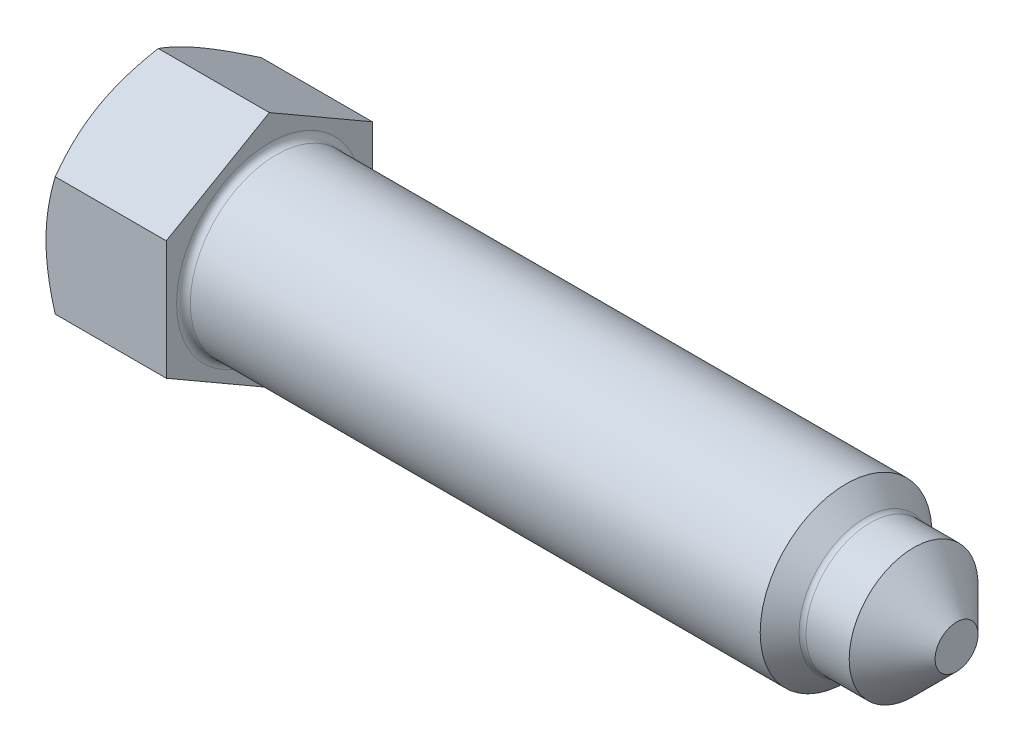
from build123d import *

# Parameters (mm, degrees)
BASEHEAD_DEPTH = 14
HEADFILLET_R   = 0.8
POINTFILLET_R  = 0.8


with BuildPart() as part:
    # HexSke → BaseHead (new body)
    with BuildSketch(Plane(origin=(0, 0, 0), x_dir=(0, 0, -1), z_dir=(1, 0, 0))):
        Polygon((12, 6.92820323), (12, -6.92820323), (0, -13.856406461), (-12, -6.92820323), (-12, 6.92820323), (0, 13.856406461), align=None)
    extrude(amount=BASEHEAD_DEPTH)

    # BodySke → BaseBody (revolve)
    with BuildSketch(Plane.XY, mode=Mode.PRIVATE) as basebody_sk:
        Polygon((0, 0), (94, 0), (94, 2.5), (89, 7.5), (83.64, 7.5), (81.14, 10), (0, 10), align=None)
    revolve(basebody_sk.sketch.rotate(Axis((0, 0, 0), (1, 0, 0)), 90), axis=Axis((0, 0, 0), (1, 0, 0)))

    # Sketch3 → HeadChamfer (revolve, cut)
    with BuildSketch(Plane.XY):
        Polygon((0, 12), (3.958548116, 18.856406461), (3.958548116, 23.856406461), (-10, 23.856406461), (-10, 12), align=None)
    revolve(axis=Axis((0, 0, 0), (1, 0, 0)), mode=Mode.SUBTRACT)

    # HeadFillet
    headfillet_edges = [part.edges().sort_by_distance(p)[0] for p in [
        (14, 0, -10),
    ]]
    fillet(headfillet_edges, radius=HEADFILLET_R)

    # PointFillet
    pointfillet_edges = [part.edges().sort_by_distance(p)[0] for p in [
        (83.64, 0, -7.5),
    ]]
    fillet(pointfillet_edges, radius=POINTFILLET_R)


solid = part.part
